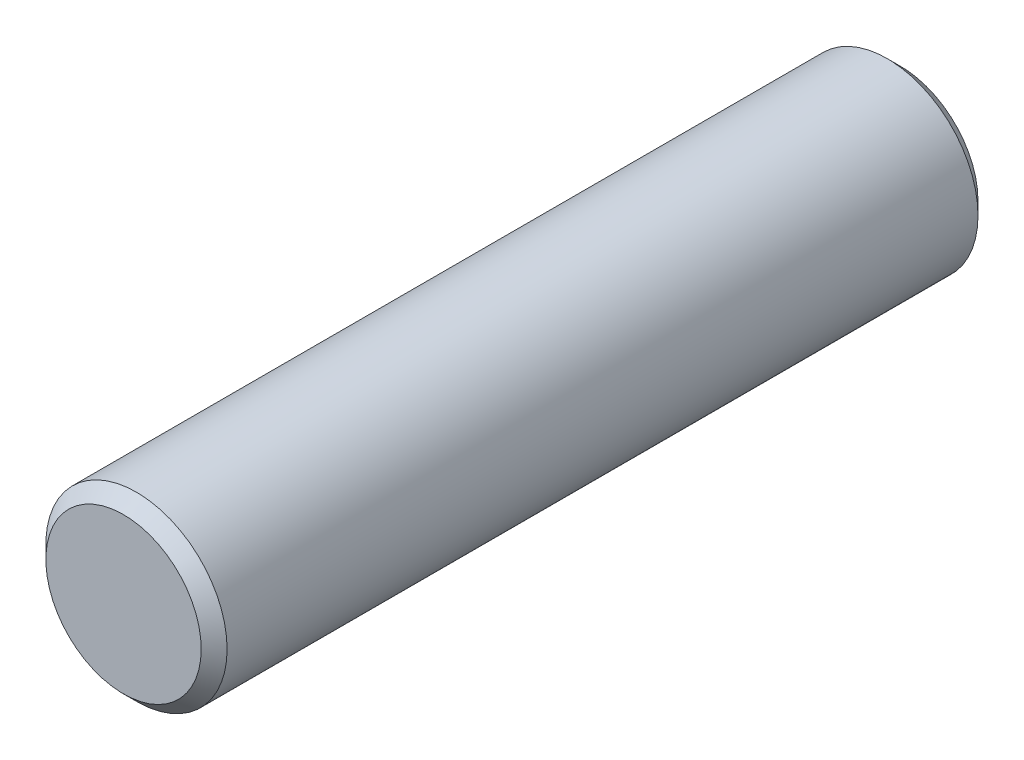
from build123d import *

# Parameters (mm, degrees)
ESQUISSE1_R      = 3.5
EXTRUSION1_DEPTH = 30
CHANFREIN1_SIZE  = 0.5


with BuildPart() as part:
    # Esquisse1 → Extrusion1 (new body)
    with BuildSketch(Plane.XY):
        Circle(ESQUISSE1_R)
    extrude(amount=EXTRUSION1_DEPTH)

    # Chanfrein1
    chanfrein1_edges = [part.edges().sort_by_distance(p)[0] for p in [
        (-3.5, 0, 0),
        (-3.5, 0, 30),
    ]]
    chamfer(chanfrein1_edges, length=CHANFREIN1_SIZE)


solid = part.part
